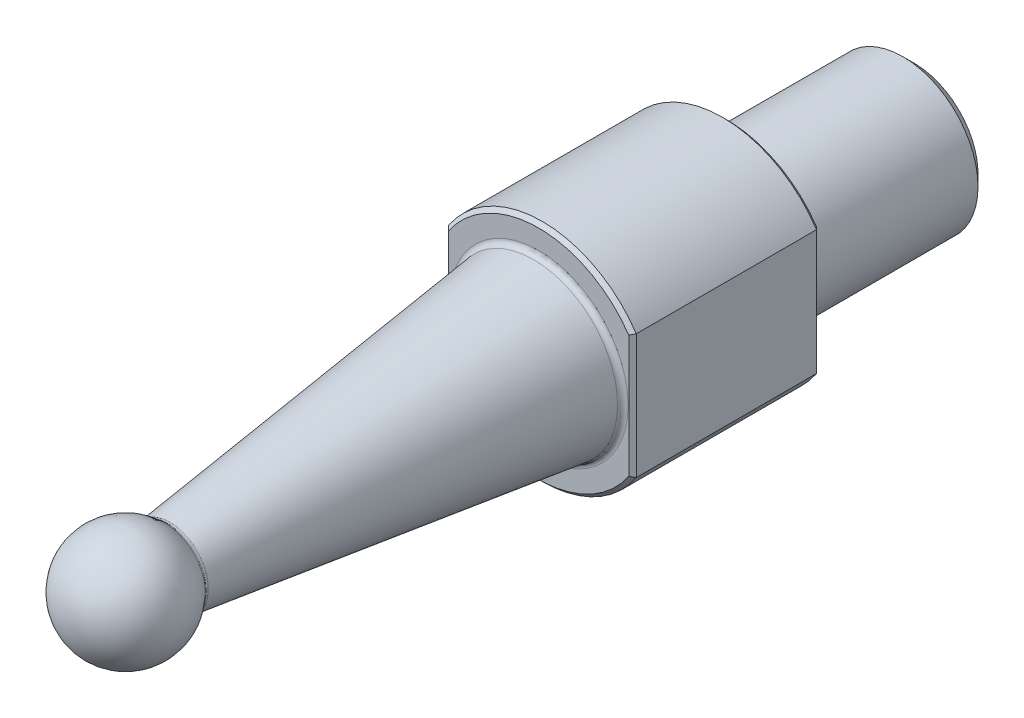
ISO-10303-21;
HEADER;
FILE_DESCRIPTION(('STEP AP214'),'2;1');
FILE_NAME('part.step','',(''),(''),'','','');
FILE_SCHEMA(('AUTOMOTIVE_DESIGN { 1 0 10303 214 1 1 1 1 }'));
ENDSEC;
DATA;
#1=APPLICATION_CONTEXT('core data for automotive mechanical design processes');
#2=APPLICATION_PROTOCOL_DEFINITION('international standard','automotive_design',2000,#1);
#3=PRODUCT_CONTEXT('',#1,'mechanical');
#4=PRODUCT('Part','Part','',(#3));
#5=PRODUCT_RELATED_PRODUCT_CATEGORY('part','',(#4));
#6=PRODUCT_DEFINITION_FORMATION('','',#4);
#7=PRODUCT_DEFINITION_CONTEXT('part definition',#1,'design');
#8=PRODUCT_DEFINITION('design','',#6,#7);
#9=PRODUCT_DEFINITION_SHAPE('','',#8);
#10=(LENGTH_UNIT() NAMED_UNIT(*) SI_UNIT(.MILLI.,.METRE.));
#11=(NAMED_UNIT(*) PLANE_ANGLE_UNIT() SI_UNIT($,.RADIAN.));
#12=(NAMED_UNIT(*) SI_UNIT($,.STERADIAN.) SOLID_ANGLE_UNIT());
#13=UNCERTAINTY_MEASURE_WITH_UNIT(LENGTH_MEASURE(1.E-05),#10,'distance_accuracy_value','');
#14=(GEOMETRIC_REPRESENTATION_CONTEXT(3) GLOBAL_UNCERTAINTY_ASSIGNED_CONTEXT((#13)) GLOBAL_UNIT_ASSIGNED_CONTEXT((#10,
#11,#12)) REPRESENTATION_CONTEXT('',''));
#15=CARTESIAN_POINT('',(0.,0.,0.));
#16=DIRECTION('',(0.,0.,1.));
#17=DIRECTION('',(1.,0.,0.));
#18=AXIS2_PLACEMENT_3D('',#15,#16,#17);
#19=CARTESIAN_POINT('',(529.857156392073,-136.049111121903,0.));
#20=DIRECTION('',(0.,0.,1.));
#21=DIRECTION('',(1.,0.,0.));
#22=AXIS2_PLACEMENT_3D('',#19,#20,#21);
#23=PLANE('',#22);
#24=CARTESIAN_POINT('',(529.857156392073,-136.049111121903,0.));
#25=DIRECTION('',(0.,0.,1.));
#26=DIRECTION('',(1.,0.,0.));
#27=AXIS2_PLACEMENT_3D('',#24,#25,#26);
#28=CIRCLE('',#27,2.9);
#29=CARTESIAN_POINT('',(532.257156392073,-137.676993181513,0.));
#30=VERTEX_POINT('',#29);
#31=CARTESIAN_POINT('',(527.457156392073,-137.676993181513,0.));
#32=VERTEX_POINT('',#31);
#33=EDGE_CURVE('E197',#30,#32,#28,.F.);
#34=ORIENTED_EDGE('',*,*,#33,.T.);
#35=DIRECTION('',(0.,1.,0.));
#36=VECTOR('',#35,1.);
#37=CARTESIAN_POINT('',(527.457156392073,-134.390798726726,0.));
#38=LINE('',#37,#36);
#39=CARTESIAN_POINT('',(527.457156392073,-134.421229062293,0.));
#40=VERTEX_POINT('',#39);
#41=EDGE_CURVE('E199',#32,#40,#38,.T.);
#42=ORIENTED_EDGE('',*,*,#41,.T.);
#43=CARTESIAN_POINT('',(529.857156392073,-136.049111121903,0.));
#44=DIRECTION('',(0.,0.,1.));
#45=DIRECTION('',(1.,0.,0.));
#46=AXIS2_PLACEMENT_3D('',#43,#44,#45);
#47=CIRCLE('',#46,2.89999999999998);
#48=CARTESIAN_POINT('',(532.257156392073,-134.421229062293,0.));
#49=VERTEX_POINT('',#48);
#50=EDGE_CURVE('E193',#40,#49,#47,.F.);
#51=ORIENTED_EDGE('',*,*,#50,.T.);
#52=DIRECTION('',(0.,-1.,0.));
#53=VECTOR('',#52,1.);
#54=CARTESIAN_POINT('',(532.257156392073,-137.707423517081,0.));
#55=LINE('',#54,#53);
#56=EDGE_CURVE('E195',#49,#30,#55,.T.);
#57=ORIENTED_EDGE('',*,*,#56,.T.);
#58=EDGE_LOOP('',(#34,#42,#51,#57));
#59=FACE_BOUND('',#58,.T.);
#60=CARTESIAN_POINT('',(529.857156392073,-136.049111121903,0.));
#61=DIRECTION('',(0.,0.,1.));
#62=DIRECTION('',(1.,0.,0.));
#63=AXIS2_PLACEMENT_3D('',#60,#61,#62);
#64=CIRCLE('',#63,2.);
#65=CARTESIAN_POINT('',(531.857156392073,-136.049111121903,0.));
#66=VERTEX_POINT('',#65);
#67=EDGE_CURVE('E180',#66,#66,#64,.F.);
#68=ORIENTED_EDGE('',*,*,#67,.F.);
#69=EDGE_LOOP('',(#68));
#70=FACE_BOUND('',#69,.T.);
#71=ADVANCED_FACE('F45',(#59,#70),#23,.F.);
#72=CARTESIAN_POINT('',(529.857156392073,-136.049111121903,16.));
#73=DIRECTION('',(0.999972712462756,0.00401121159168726,0.00620358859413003));
#74=DIRECTION('',(-0.00399590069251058,0.999988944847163,-0.00247849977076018));
#75=AXIS2_PLACEMENT_3D('',#72,#73,#74);
#76=SPHERICAL_SURFACE('',#75,1.5);
#77=CARTESIAN_POINT('',(528.798125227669,-135.937211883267,14.9436233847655));
#78=CARTESIAN_POINT('',(528.849242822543,-135.942613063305,14.8918052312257));
#79=CARTESIAN_POINT('',(528.840239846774,-135.941661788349,14.8193804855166));
#80=CARTESIAN_POINT('',(528.79182810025,-135.996808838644,14.943623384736));
#81=CARTESIAN_POINT('',(528.843249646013,-135.999333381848,14.8918052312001));
#82=CARTESIAN_POINT('',(528.834193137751,-135.998888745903,14.8193804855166));
#83=CARTESIAN_POINT('',(528.790573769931,-136.056938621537,14.9436233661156));
#84=CARTESIAN_POINT('',(528.842055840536,-136.056560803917,14.8918052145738));
#85=CARTESIAN_POINT('',(528.832988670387,-136.056627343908,14.8193804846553));
#86=CARTESIAN_POINT('',(528.798179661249,-136.176453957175,14.9436233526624));
#87=CARTESIAN_POINT('',(528.849294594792,-136.170307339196,14.8918052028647));
#88=CARTESIAN_POINT('',(528.840292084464,-136.171389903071,14.8193804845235));
#89=CARTESIAN_POINT('',(528.807023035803,-136.2358405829,14.94362335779));
#90=CARTESIAN_POINT('',(528.857711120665,-136.226827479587,14.8918052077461));
#91=CARTESIAN_POINT('',(528.848783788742,-136.228414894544,14.8193804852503));
#92=CARTESIAN_POINT('',(528.834567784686,-136.352378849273,14.9436233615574));
#93=CARTESIAN_POINT('',(528.883926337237,-136.337740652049,14.8918052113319));
#94=CARTESIAN_POINT('',(528.875233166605,-136.34031877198,14.8193804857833));
#95=CARTESIAN_POINT('',(528.853284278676,-136.409526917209,14.9436233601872));
#96=CARTESIAN_POINT('',(528.901739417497,-136.392130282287,14.8918052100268));
#97=CARTESIAN_POINT('',(528.893205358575,-136.395194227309,14.8193804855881));
#98=CARTESIAN_POINT('',(528.900019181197,-136.519788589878,14.9436233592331));
#99=CARTESIAN_POINT('',(528.946218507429,-136.497069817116,14.8918052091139));
#100=CARTESIAN_POINT('',(528.93808174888,-136.501071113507,14.8193804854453));
#101=CARTESIAN_POINT('',(528.928024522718,-136.572907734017,14.9436233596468));
#102=CARTESIAN_POINT('',(528.972872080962,-136.547624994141,14.8918052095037));
#103=CARTESIAN_POINT('',(528.964973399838,-136.552077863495,14.8193804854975));
#104=CARTESIAN_POINT('',(528.992595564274,-136.673765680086,14.9436233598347));
#105=CARTESIAN_POINT('',(529.034326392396,-136.643614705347,14.8918052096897));
#106=CARTESIAN_POINT('',(529.026976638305,-136.648924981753,14.8193804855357));
#107=CARTESIAN_POINT('',(529.029173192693,-136.721496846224,14.943623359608));
#108=CARTESIAN_POINT('',(529.069138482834,-136.689041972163,14.8918052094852));
#109=CARTESIAN_POINT('',(529.062099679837,-136.694758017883,14.8193804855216));
#110=CARTESIAN_POINT('',(529.109770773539,-136.810073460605,14.9436233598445));
#111=CARTESIAN_POINT('',(529.145845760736,-136.773343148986,14.8918052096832));
#112=CARTESIAN_POINT('',(529.139492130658,-136.779812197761,14.8193804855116));
#113=CARTESIAN_POINT('',(529.153780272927,-136.850928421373,14.9436233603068));
#114=CARTESIAN_POINT('',(529.187730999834,-136.812226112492,14.891805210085));
#115=CARTESIAN_POINT('',(529.18175150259,-136.819042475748,14.8193804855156));
#116=CARTESIAN_POINT('',(529.248096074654,-136.924727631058,14.9436233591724));
#117=CARTESIAN_POINT('',(529.27749434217,-136.882463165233,14.8918052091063));
#118=CARTESIAN_POINT('',(529.272316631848,-136.889906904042,14.8193804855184));
#119=CARTESIAN_POINT('',(529.298411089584,-136.957660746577,14.9436233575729));
#120=CARTESIAN_POINT('',(529.325380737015,-136.91380665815,14.8918052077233));
#121=CARTESIAN_POINT('',(529.320630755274,-136.921530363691,14.8193804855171));
#122=CARTESIAN_POINT('',(529.403784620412,-137.014565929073,14.9436233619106));
#123=CARTESIAN_POINT('',(529.425668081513,-136.967965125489,14.8918052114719));
#124=CARTESIAN_POINT('',(529.421813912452,-136.976172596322,14.8193804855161));
#125=CARTESIAN_POINT('',(529.458836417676,-137.038550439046,14.9436233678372));
#126=CARTESIAN_POINT('',(529.478062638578,-136.990791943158,14.8918052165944));
#127=CARTESIAN_POINT('',(529.474676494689,-136.999203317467,14.8193804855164));
#128=CARTESIAN_POINT('',(529.572263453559,-137.076970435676,14.9436233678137));
#129=CARTESIAN_POINT('',(529.586014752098,-137.027357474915,14.8918052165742));
#130=CARTESIAN_POINT('',(529.583592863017,-137.036095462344,14.8193804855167));
#131=CARTESIAN_POINT('',(529.630643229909,-137.091392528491,14.943623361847));
#132=CARTESIAN_POINT('',(529.641576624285,-137.041083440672,14.8918052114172));
#133=CARTESIAN_POINT('',(529.639651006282,-137.049944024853,14.8193804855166));
#134=CARTESIAN_POINT('',(529.74891269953,-137.110210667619,14.943623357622));
#135=CARTESIAN_POINT('',(529.754137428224,-137.058993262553,14.8918052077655));
#136=CARTESIAN_POINT('',(529.753217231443,-137.068013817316,14.8193804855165));
#137=CARTESIAN_POINT('',(529.808800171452,-137.114620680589,14.943623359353));
#138=CARTESIAN_POINT('',(529.811134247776,-137.063190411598,14.8918052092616));
#139=CARTESIAN_POINT('',(529.810723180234,-137.072248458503,14.8193804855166));
#140=CARTESIAN_POINT('',(529.928550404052,-137.113329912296,14.9436233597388));
#141=CARTESIAN_POINT('',(529.925104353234,-137.061961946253,14.8918052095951));
#142=CARTESIAN_POINT('',(529.925711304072,-137.07100902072,14.8193804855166));
#143=CARTESIAN_POINT('',(529.98841301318,-137.107614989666,14.9436233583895));
#144=CARTESIAN_POINT('',(529.98207749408,-137.056522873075,14.8918052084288));
#145=CARTESIAN_POINT('',(529.983193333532,-137.065521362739,14.8193804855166));
#146=CARTESIAN_POINT('',(530.106244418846,-137.086224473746,14.9436233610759));
#147=CARTESIAN_POINT('',(530.094221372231,-137.036164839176,14.8918052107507));
#148=CARTESIAN_POINT('',(530.096338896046,-137.044981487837,14.8193804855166));
#149=CARTESIAN_POINT('',(530.1642157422,-137.070562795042,14.9436233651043));
#150=CARTESIAN_POINT('',(530.149394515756,-137.021259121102,14.8918052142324));
#151=CARTESIAN_POINT('',(530.152004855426,-137.029942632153,14.8193804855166));
#152=CARTESIAN_POINT('',(530.276788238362,-137.029706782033,14.9436233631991));
#153=CARTESIAN_POINT('',(530.256533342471,-136.982375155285,14.8918052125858));
#154=CARTESIAN_POINT('',(530.260100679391,-136.990711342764,14.8193804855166));
#155=CARTESIAN_POINT('',(530.331384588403,-137.004499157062,14.9436233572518));
#156=CARTESIAN_POINT('',(530.308494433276,-136.958384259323,14.8918052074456));
#157=CARTESIAN_POINT('',(530.312525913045,-136.966506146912,14.8193804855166));
#158=CARTESIAN_POINT('',(530.435493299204,-136.945311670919,14.9436233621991));
#159=CARTESIAN_POINT('',(530.407577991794,-136.902053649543,14.8918052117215));
#160=CARTESIAN_POINT('',(530.412494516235,-136.909672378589,14.8193804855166));
#161=CARTESIAN_POINT('',(530.48501264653,-136.911344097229,14.9436233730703));
#162=CARTESIAN_POINT('',(530.454707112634,-136.869725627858,14.8918052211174));
#163=CARTESIAN_POINT('',(530.460044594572,-136.877055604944,14.8193804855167));
#164=CARTESIAN_POINT('',(530.577715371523,-136.835529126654,14.9436233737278));
#165=CARTESIAN_POINT('',(530.542935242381,-136.797570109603,14.8918052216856));
#166=CARTESIAN_POINT('',(530.549060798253,-136.804255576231,14.8193804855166));
#167=CARTESIAN_POINT('',(530.620889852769,-136.793670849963,14.9436233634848));
#168=CARTESIAN_POINT('',(530.584025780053,-136.757732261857,14.8918052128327));
#169=CARTESIAN_POINT('',(530.590518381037,-136.764061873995,14.8193804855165));
#170=CARTESIAN_POINT('',(530.699538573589,-136.703360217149,14.9436233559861));
#171=CARTESIAN_POINT('',(530.658878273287,-136.671780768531,14.8918052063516));
#172=CARTESIAN_POINT('',(530.666039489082,-136.677342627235,14.8193804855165));
#173=CARTESIAN_POINT('',(530.735023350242,-136.654917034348,14.9436233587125));
#174=CARTESIAN_POINT('',(530.692650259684,-136.625675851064,14.8918052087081));
#175=CARTESIAN_POINT('',(530.700113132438,-136.630825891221,14.8193804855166));
#176=CARTESIAN_POINT('',(530.797402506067,-136.552691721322,14.9436233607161));
#177=CARTESIAN_POINT('',(530.752018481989,-136.528384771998,14.8918052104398));
#178=CARTESIAN_POINT('',(530.760011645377,-136.532665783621,14.8193804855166));
#179=CARTESIAN_POINT('',(530.824285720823,-136.498902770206,14.9436233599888));
#180=CARTESIAN_POINT('',(530.777604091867,-136.477192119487,14.8918052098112));
#181=CARTESIAN_POINT('',(530.785825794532,-136.481015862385,14.8193804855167));
#182=CARTESIAN_POINT('',(530.868609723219,-136.387662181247,14.943623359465));
#183=CARTESIAN_POINT('',(530.819788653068,-136.371320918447,14.8918052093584));
#184=CARTESIAN_POINT('',(530.82838716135,-136.374198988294,14.8193804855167));
#185=CARTESIAN_POINT('',(530.886061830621,-136.330215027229,14.9436233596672));
#186=CARTESIAN_POINT('',(530.83639837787,-136.316646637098,14.8918052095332));
#187=CARTESIAN_POINT('',(530.845145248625,-136.319036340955,14.8193804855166));
#188=CARTESIAN_POINT('',(530.914173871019,-136.198603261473,14.9436233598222));
#189=CARTESIAN_POINT('',(530.863153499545,-136.191387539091,14.8918052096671));
#190=CARTESIAN_POINT('',(530.872139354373,-136.192658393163,14.8193804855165));
#191=CARTESIAN_POINT('',(530.92207489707,-136.123826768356,14.9436233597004));
#192=CARTESIAN_POINT('',(530.870673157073,-136.120220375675,14.8918052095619));
#193=CARTESIAN_POINT('',(530.879726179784,-136.120855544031,14.8193804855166));
#194=CARTESIAN_POINT('',(530.922089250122,-135.989246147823,14.9436233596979));
#195=CARTESIAN_POINT('',(530.870686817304,-135.992135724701,14.8918052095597));
#196=CARTESIAN_POINT('',(530.87973996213,-135.991626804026,14.8193804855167));
#197=CARTESIAN_POINT('',(530.917028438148,-135.929420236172,14.943623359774));
#198=CARTESIAN_POINT('',(530.865870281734,-135.935197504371,14.8918052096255));
#199=CARTESIAN_POINT('',(530.874880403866,-135.934179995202,14.8193804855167));
#200=CARTESIAN_POINT('',(530.896931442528,-135.811372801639,14.9436233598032));
#201=CARTESIAN_POINT('',(530.846743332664,-135.822848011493,14.8918052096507));
#202=CARTESIAN_POINT('',(530.855582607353,-135.820826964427,14.8193804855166));
#203=CARTESIAN_POINT('',(530.881883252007,-135.753153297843,14.9436233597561));
#204=CARTESIAN_POINT('',(530.832421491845,-135.767438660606,14.89180520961));
#205=CARTESIAN_POINT('',(530.841132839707,-135.764922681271,14.8193804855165));
#206=CARTESIAN_POINT('',(530.842245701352,-135.640148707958,14.9436233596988));
#207=CARTESIAN_POINT('',(530.794697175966,-135.65988860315,14.8918052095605));
#208=CARTESIAN_POINT('',(530.803071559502,-135.656411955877,14.8193804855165));
#209=CARTESIAN_POINT('',(530.817668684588,-135.585359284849,14.9436233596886));
#210=CARTESIAN_POINT('',(530.771306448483,-135.607743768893,14.8918052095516));
#211=CARTESIAN_POINT('',(530.779471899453,-135.603801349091,14.8193804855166));
#212=CARTESIAN_POINT('',(530.759630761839,-135.48060607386,14.9436233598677));
#213=CARTESIAN_POINT('',(530.716069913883,-135.50804681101,14.8918052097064));
#214=CARTESIAN_POINT('',(530.723741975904,-135.503213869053,14.8193804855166));
#215=CARTESIAN_POINT('',(530.726157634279,-135.430649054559,14.9436233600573));
#216=CARTESIAN_POINT('',(530.684212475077,-135.460501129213,14.8918052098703));
#217=CARTESIAN_POINT('',(530.691599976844,-135.455243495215,14.8193804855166));
#218=CARTESIAN_POINT('',(530.651346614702,-135.337134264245,14.9436233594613));
#219=CARTESIAN_POINT('',(530.61301245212,-135.371500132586,14.8918052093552));
#220=CARTESIAN_POINT('',(530.619763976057,-135.36544751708,14.8193804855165));
#221=CARTESIAN_POINT('',(530.610019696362,-135.293567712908,14.9436233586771));
#222=CARTESIAN_POINT('',(530.573680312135,-135.330036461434,14.8918052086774));
#223=CARTESIAN_POINT('',(530.580080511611,-135.323613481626,14.8193804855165));
#224=CARTESIAN_POINT('',(530.520579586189,-135.213929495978,14.9436233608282));
#225=CARTESIAN_POINT('',(530.488557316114,-135.254242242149,14.8918052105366));
#226=CARTESIAN_POINT('',(530.494197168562,-135.247142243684,14.8193804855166));
#227=CARTESIAN_POINT('',(530.472456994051,-135.177868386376,14.9436233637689));
#228=CARTESIAN_POINT('',(530.442757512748,-135.21992173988,14.8918052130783));
#229=CARTESIAN_POINT('',(530.447988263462,-135.212515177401,14.8193804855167));
#230=CARTESIAN_POINT('',(530.370908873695,-135.11438797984,14.9436233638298));
#231=CARTESIAN_POINT('',(530.346110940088,-135.159505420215,14.8918052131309));
#232=CARTESIAN_POINT('',(530.350478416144,-135.151559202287,14.8193804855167));
#233=CARTESIAN_POINT('',(530.317490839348,-135.086956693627,14.9436233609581));
#234=CARTESIAN_POINT('',(530.29527130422,-135.133398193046,14.891805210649));
#235=CARTESIAN_POINT('',(530.299184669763,-135.125218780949,14.8193804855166));
#236=CARTESIAN_POINT('',(530.206731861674,-135.041412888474,14.9436233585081));
#237=CARTESIAN_POINT('',(530.189858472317,-135.090052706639,14.8918052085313));
#238=CARTESIAN_POINT('',(530.192830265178,-135.081486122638,14.8193804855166));
#239=CARTESIAN_POINT('',(530.149385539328,-135.02331344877,14.9436233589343));
#240=CARTESIAN_POINT('',(530.135280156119,-135.072826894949,14.8918052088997));
#241=CARTESIAN_POINT('',(530.137764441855,-135.064106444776,14.8193804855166));
#242=CARTESIAN_POINT('',(530.032549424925,-134.997024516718,14.9436233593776));
#243=CARTESIAN_POINT('',(530.024083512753,-135.047806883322,14.8918052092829));
#244=CARTESIAN_POINT('',(530.025574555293,-135.038862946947,14.8193804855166));
#245=CARTESIAN_POINT('',(529.973062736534,-134.988821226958,14.9436233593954));
#246=CARTESIAN_POINT('',(529.967468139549,-135.039999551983,14.8918052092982));
#247=CARTESIAN_POINT('',(529.968453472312,-135.030985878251,14.8193804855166));
#248=CARTESIAN_POINT('',(529.853472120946,-134.982506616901,14.9436233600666));
#249=CARTESIAN_POINT('',(529.853649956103,-135.033989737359,14.8918052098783));
#250=CARTESIAN_POINT('',(529.853618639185,-135.024922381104,14.8193804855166));
#251=CARTESIAN_POINT('',(529.793367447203,-134.984409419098,14.9436233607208));
#252=CARTESIAN_POINT('',(529.796446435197,-135.035800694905,14.8918052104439));
#253=CARTESIAN_POINT('',(529.795904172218,-135.026749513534,14.8193804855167));
#254=CARTESIAN_POINT('',(529.674415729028,-134.99827583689,14.9436233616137));
#255=CARTESIAN_POINT('',(529.683236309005,-135.048997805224,14.8918052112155));
#256=CARTESIAN_POINT('',(529.681682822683,-135.040064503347,14.8193804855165));
#257=CARTESIAN_POINT('',(529.615567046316,-135.010225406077,14.9436233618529));
#258=CARTESIAN_POINT('',(529.62722814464,-135.06037058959,14.891805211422));
#259=CARTESIAN_POINT('',(529.625174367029,-135.051538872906,14.8193804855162));
#260=CARTESIAN_POINT('',(529.500627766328,-135.043851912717,14.9436233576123));
#261=CARTESIAN_POINT('',(529.517836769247,-135.092374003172,14.8918052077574));
#262=CARTESIAN_POINT('',(529.5148058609,-135.083828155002,14.819380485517));
#263=CARTESIAN_POINT('',(529.444541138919,-135.065542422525,14.943623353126));
#264=CARTESIAN_POINT('',(529.464457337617,-135.113017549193,14.8918052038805));
#265=CARTESIAN_POINT('',(529.460949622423,-135.104656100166,14.819380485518));
#266=CARTESIAN_POINT('',(529.336884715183,-135.11800086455,14.9436233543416));
#267=CARTESIAN_POINT('',(529.361997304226,-135.162943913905,14.8918052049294));
#268=CARTESIAN_POINT('',(529.357574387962,-135.155028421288,14.8193804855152));
#269=CARTESIAN_POINT('',(529.285308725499,-135.148756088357,14.9436233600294));
#270=CARTESIAN_POINT('',(529.312910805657,-135.192214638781,14.891805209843));
#271=CARTESIAN_POINT('',(529.308049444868,-135.184560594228,14.8193804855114));
#272=CARTESIAN_POINT('',(529.187979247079,-135.218532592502,14.943623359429));
#273=CARTESIAN_POINT('',(529.220279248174,-135.258623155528,14.8918052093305));
#274=CARTESIAN_POINT('',(529.214590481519,-135.251562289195,14.8193804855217));
#275=CARTESIAN_POINT('',(529.142233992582,-135.257565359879,14.9436233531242));
#276=CARTESIAN_POINT('',(529.176742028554,-135.295771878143,14.8918052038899));
#277=CARTESIAN_POINT('',(529.170664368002,-135.289042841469,14.8193804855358));
#278=CARTESIAN_POINT('',(529.058010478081,-135.342701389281,14.9436233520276));
#279=CARTESIAN_POINT('',(529.096583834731,-135.376798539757,14.8918052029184));
#280=CARTESIAN_POINT('',(529.089790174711,-135.370793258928,14.8193804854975));
#281=CARTESIAN_POINT('',(529.01952214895,-135.388794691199,14.9436233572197));
#282=CARTESIAN_POINT('',(529.059953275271,-135.420667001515,14.8918052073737));
#283=CARTESIAN_POINT('',(529.052832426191,-135.415053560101,14.8193804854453));
#284=CARTESIAN_POINT('',(528.950775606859,-135.486854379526,14.9436233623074));
#285=CARTESIAN_POINT('',(528.994525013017,-135.513993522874,14.8918052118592));
#286=CARTESIAN_POINT('',(528.986819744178,-135.509213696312,14.819380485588));
#287=CARTESIAN_POINT('',(528.920529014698,-135.538828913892,14.9436233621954));
#288=CARTESIAN_POINT('',(528.965738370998,-135.563459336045,14.8918052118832));
#289=CARTESIAN_POINT('',(528.957775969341,-135.559121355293,14.8193804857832));
#290=CARTESIAN_POINT('',(528.869237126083,-135.647037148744,14.9436233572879));
#291=CARTESIAN_POINT('',(528.916922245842,-135.666444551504,14.8918052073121));
#292=CARTESIAN_POINT('',(528.908523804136,-135.663026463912,14.8193804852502));
#293=CARTESIAN_POINT('',(528.848177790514,-135.703264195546,14.9436233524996));
#294=CARTESIAN_POINT('',(528.896879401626,-135.719957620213,14.8918052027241));
#295=CARTESIAN_POINT('',(528.888301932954,-135.717017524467,14.8193804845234));
#296=CARTESIAN_POINT('',(528.815762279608,-135.818550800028,14.9436233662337));
#297=CARTESIAN_POINT('',(528.866028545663,-135.82967953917,14.891805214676));
#298=CARTESIAN_POINT('',(528.857175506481,-135.82771951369,14.8193804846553));
#299=CARTESIAN_POINT('',(528.804422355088,-135.87761492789,14.9436233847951));
#300=CARTESIAN_POINT('',(528.855235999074,-135.885892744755,14.8918052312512));
#301=CARTESIAN_POINT('',(528.846286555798,-135.884434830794,14.8193804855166));
#302=CARTESIAN_POINT('',(528.798125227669,-135.937211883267,14.9436233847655));
#303=CARTESIAN_POINT('',(528.849242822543,-135.942613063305,14.8918052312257));
#304=CARTESIAN_POINT('',(528.840239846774,-135.941661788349,14.8193804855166));
#305=(BOUNDED_SURFACE() B_SPLINE_SURFACE(3,2,((#77,#78,#79),(#80,#81,#82),(#83,#84,#85),(#86,
#87,#88),(#89,#90,#91),(#92,#93,#94),(#95,#96,#97),(#98,#99,#100),(#101,#102,#103),(#104,#105,
#106),(#107,#108,#109),(#110,#111,#112),(#113,#114,#115),(#116,#117,#118),(#119,#120,#121),
(#122,#123,#124),(#125,#126,#127),(#128,#129,#130),(#131,#132,#133),(#134,#135,#136),(#137,#138,
#139),(#140,#141,#142),(#143,#144,#145),(#146,#147,#148),(#149,#150,#151),(#152,#153,#154),
(#155,#156,#157),(#158,#159,#160),(#161,#162,#163),(#164,#165,#166),(#167,#168,#169),(#170,#171,
#172),(#173,#174,#175),(#176,#177,#178),(#179,#180,#181),(#182,#183,#184),(#185,#186,#187),
(#188,#189,#190),(#191,#192,#193),(#194,#195,#196),(#197,#198,#199),(#200,#201,#202),(#203,#204,
#205),(#206,#207,#208),(#209,#210,#211),(#212,#213,#214),(#215,#216,#217),(#218,#219,#220),
(#221,#222,#223),(#224,#225,#226),(#227,#228,#229),(#230,#231,#232),(#233,#234,#235),(#236,#237,
#238),(#239,#240,#241),(#242,#243,#244),(#245,#246,#247),(#248,#249,#250),(#251,#252,#253),
(#254,#255,#256),(#257,#258,#259),(#260,#261,#262),(#263,#264,#265),(#266,#267,#268),(#269,#270,
#271),(#272,#273,#274),(#275,#276,#277),(#278,#279,#280),(#281,#282,#283),(#284,#285,#286),
(#287,#288,#289),(#290,#291,#292),(#293,#294,#295),(#296,#297,#298),(#299,#300,#301),(#302,#303,
#304)),.UNSPECIFIED.,.T.,.F.,.F.) B_SPLINE_SURFACE_WITH_KNOTS((4,2,2,2,2,2,2,2,2,2,2,2,2,2,2,2,
2,2,2,2,2,2,2,2,2,2,2,2,2,2,2,2,2,2,2,2,2,4),(3,3),(0.,0.197530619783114,0.39473215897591,
0.592236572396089,0.789464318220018,0.98696815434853,1.18419647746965,1.38170038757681,
1.578928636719,1.77643255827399,1.97366079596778,2.17116471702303,2.36839295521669,
2.56589680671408,2.76312511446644,2.96062737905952,3.15785727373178,3.35534213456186,
3.55258943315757,3.79876776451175,3.99601506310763,4.19349992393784,4.39072981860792,
4.58823208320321,4.78546039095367,4.9829642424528,5.18019248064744,5.3776964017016,
5.57492463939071,5.77242856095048,5.9696568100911,6.16716072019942,6.36438904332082,
6.56189287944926,6.75912062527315,6.95662503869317,7.15382657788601,7.35135719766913),(0.,1.),
.UNSPECIFIED.) GEOMETRIC_REPRESENTATION_ITEM() RATIONAL_B_SPLINE_SURFACE(((1.,0.899198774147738,
1.),(1.,0.899198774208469,1.),(1.,0.899198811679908,1.),(1.,0.899198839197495,1.),(1.,
0.899198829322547,1.),(1.,0.899198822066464,1.),(1.,0.899198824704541,1.),(1.,0.899198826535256,
1.),(1.,0.899198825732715,1.),(1.,0.899198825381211,1.),(1.,0.899198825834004,1.),(1.,
0.899198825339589,1.),(1.,0.899198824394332,1.),(1.,0.899198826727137,1.),(1.,0.899198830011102,
1.),(1.,0.899198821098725,1.),(1.,0.899198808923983,1.),(1.,0.899198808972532,1.),(1.,
0.899198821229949,1.),(1.,0.899198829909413,1.),(1.,0.89919882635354,1.),(1.,0.899198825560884,
1.),(1.,0.89919882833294,1.),(1.,0.899198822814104,1.),(1.,0.899198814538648,1.),(1.,
0.899198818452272,1.),(1.,0.899198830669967,1.),(1.,0.899198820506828,1.),(1.,0.89919879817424,
1.),(1.,0.899198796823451,1.),(1.,0.899198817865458,1.),(1.,0.899198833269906,1.),(1.,
0.8991988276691,1.),(1.,0.899198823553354,1.),(1.,0.899198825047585,1.),(1.,0.899198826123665,
1.),(1.,0.899198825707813,1.),(1.,0.899198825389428,1.),(1.,0.899198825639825,1.),(1.,
0.899198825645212,1.),(1.,0.899198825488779,1.),(1.,0.89919882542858,1.),(1.,0.899198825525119,
1.),(1.,0.89919882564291,1.),(1.,0.89919882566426,1.),(1.,0.899198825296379,1.),(1.,
0.899198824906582,1.),(1.,0.899198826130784,1.),(1.,0.899198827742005,1.),(1.,0.899198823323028,
1.),(1.,0.899198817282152,1.),(1.,0.899198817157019,1.),(1.,0.899198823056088,1.),(1.,
0.899198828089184,1.),(1.,0.899198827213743,1.),(1.,0.899198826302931,1.),(1.,0.899198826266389,
1.),(1.,0.899198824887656,1.),(1.,0.899198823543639,1.),(1.,0.899198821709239,1.),(1.,
0.899198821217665,1.),(1.,0.899198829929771,1.),(1.,0.899198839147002,1.),(1.,0.899198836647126,
1.),(1.,0.899198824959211,1.),(1.,0.899198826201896,1.),(1.,0.899198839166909,1.),(1.,
0.899198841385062,1.),(1.,0.899198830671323,1.),(1.,0.899198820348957,1.),(1.,0.899198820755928,
1.),(1.,0.899198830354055,1.),(1.,0.89919883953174,1.),(1.,0.899198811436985,1.),(1.,
0.899198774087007,1.),(1.,0.899198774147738,1.))) REPRESENTATION_ITEM('') SURFACE());
#306=CARTESIAN_POINT('',(528.798125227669,-135.937211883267,14.9436233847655));
#307=CARTESIAN_POINT('',(528.79182810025,-135.996808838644,14.943623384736));
#308=CARTESIAN_POINT('',(528.790573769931,-136.056938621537,14.9436233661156));
#309=CARTESIAN_POINT('',(528.798179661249,-136.176453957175,14.9436233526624));
#310=CARTESIAN_POINT('',(528.807023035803,-136.2358405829,14.94362335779));
#311=CARTESIAN_POINT('',(528.834567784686,-136.352378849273,14.9436233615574));
#312=CARTESIAN_POINT('',(528.853284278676,-136.409526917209,14.9436233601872));
#313=CARTESIAN_POINT('',(528.900019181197,-136.519788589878,14.9436233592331));
#314=CARTESIAN_POINT('',(528.928024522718,-136.572907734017,14.9436233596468));
#315=CARTESIAN_POINT('',(528.992595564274,-136.673765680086,14.9436233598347));
#316=CARTESIAN_POINT('',(529.029173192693,-136.721496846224,14.943623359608));
#317=CARTESIAN_POINT('',(529.109770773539,-136.810073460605,14.9436233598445));
#318=CARTESIAN_POINT('',(529.153780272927,-136.850928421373,14.9436233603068));
#319=CARTESIAN_POINT('',(529.248096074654,-136.924727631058,14.9436233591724));
#320=CARTESIAN_POINT('',(529.298411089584,-136.957660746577,14.9436233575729));
#321=CARTESIAN_POINT('',(529.403784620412,-137.014565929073,14.9436233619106));
#322=CARTESIAN_POINT('',(529.458836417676,-137.038550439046,14.9436233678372));
#323=CARTESIAN_POINT('',(529.572263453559,-137.076970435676,14.9436233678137));
#324=CARTESIAN_POINT('',(529.630643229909,-137.091392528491,14.943623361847));
#325=CARTESIAN_POINT('',(529.74891269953,-137.110210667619,14.943623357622));
#326=CARTESIAN_POINT('',(529.808800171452,-137.114620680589,14.943623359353));
#327=CARTESIAN_POINT('',(529.928550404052,-137.113329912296,14.9436233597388));
#328=CARTESIAN_POINT('',(529.98841301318,-137.107614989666,14.9436233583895));
#329=CARTESIAN_POINT('',(530.106244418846,-137.086224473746,14.9436233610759));
#330=CARTESIAN_POINT('',(530.1642157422,-137.070562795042,14.9436233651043));
#331=CARTESIAN_POINT('',(530.276788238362,-137.029706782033,14.9436233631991));
#332=CARTESIAN_POINT('',(530.331384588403,-137.004499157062,14.9436233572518));
#333=CARTESIAN_POINT('',(530.435493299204,-136.945311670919,14.9436233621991));
#334=CARTESIAN_POINT('',(530.48501264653,-136.911344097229,14.9436233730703));
#335=CARTESIAN_POINT('',(530.577715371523,-136.835529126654,14.9436233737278));
#336=CARTESIAN_POINT('',(530.620889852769,-136.793670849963,14.9436233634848));
#337=CARTESIAN_POINT('',(530.699538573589,-136.703360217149,14.9436233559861));
#338=CARTESIAN_POINT('',(530.735023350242,-136.654917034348,14.9436233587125));
#339=CARTESIAN_POINT('',(530.797402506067,-136.552691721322,14.9436233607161));
#340=CARTESIAN_POINT('',(530.824285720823,-136.498902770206,14.9436233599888));
#341=CARTESIAN_POINT('',(530.868609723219,-136.387662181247,14.943623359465));
#342=CARTESIAN_POINT('',(530.886061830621,-136.330215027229,14.9436233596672));
#343=CARTESIAN_POINT('',(530.914173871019,-136.198603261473,14.9436233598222));
#344=CARTESIAN_POINT('',(530.92207489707,-136.123826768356,14.9436233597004));
#345=CARTESIAN_POINT('',(530.922089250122,-135.989246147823,14.9436233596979));
#346=CARTESIAN_POINT('',(530.917028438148,-135.929420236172,14.943623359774));
#347=CARTESIAN_POINT('',(530.896931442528,-135.811372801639,14.9436233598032));
#348=CARTESIAN_POINT('',(530.881883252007,-135.753153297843,14.9436233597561));
#349=CARTESIAN_POINT('',(530.842245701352,-135.640148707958,14.9436233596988));
#350=CARTESIAN_POINT('',(530.817668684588,-135.585359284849,14.9436233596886));
#351=CARTESIAN_POINT('',(530.759630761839,-135.48060607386,14.9436233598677));
#352=CARTESIAN_POINT('',(530.726157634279,-135.430649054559,14.9436233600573));
#353=CARTESIAN_POINT('',(530.651346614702,-135.337134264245,14.9436233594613));
#354=CARTESIAN_POINT('',(530.610019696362,-135.293567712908,14.9436233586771));
#355=CARTESIAN_POINT('',(530.520579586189,-135.213929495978,14.9436233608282));
#356=CARTESIAN_POINT('',(530.472456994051,-135.177868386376,14.9436233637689));
#357=CARTESIAN_POINT('',(530.370908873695,-135.11438797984,14.9436233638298));
#358=CARTESIAN_POINT('',(530.317490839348,-135.086956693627,14.9436233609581));
#359=CARTESIAN_POINT('',(530.206731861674,-135.041412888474,14.9436233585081));
#360=CARTESIAN_POINT('',(530.149385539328,-135.02331344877,14.9436233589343));
#361=CARTESIAN_POINT('',(530.032549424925,-134.997024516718,14.9436233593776));
#362=CARTESIAN_POINT('',(529.973062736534,-134.988821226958,14.9436233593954));
#363=CARTESIAN_POINT('',(529.853472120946,-134.982506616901,14.9436233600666));
#364=CARTESIAN_POINT('',(529.793367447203,-134.984409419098,14.9436233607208));
#365=CARTESIAN_POINT('',(529.674415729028,-134.99827583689,14.9436233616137));
#366=CARTESIAN_POINT('',(529.615567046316,-135.010225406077,14.9436233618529));
#367=CARTESIAN_POINT('',(529.500627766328,-135.043851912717,14.9436233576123));
#368=CARTESIAN_POINT('',(529.444541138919,-135.065542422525,14.943623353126));
#369=CARTESIAN_POINT('',(529.336884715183,-135.11800086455,14.9436233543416));
#370=CARTESIAN_POINT('',(529.285308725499,-135.148756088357,14.9436233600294));
#371=CARTESIAN_POINT('',(529.187979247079,-135.218532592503,14.943623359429));
#372=CARTESIAN_POINT('',(529.142233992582,-135.257565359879,14.9436233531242));
#373=CARTESIAN_POINT('',(529.058010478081,-135.342701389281,14.9436233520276));
#374=CARTESIAN_POINT('',(529.01952214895,-135.388794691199,14.9436233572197));
#375=CARTESIAN_POINT('',(528.950775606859,-135.486854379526,14.9436233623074));
#376=CARTESIAN_POINT('',(528.920529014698,-135.538828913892,14.9436233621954));
#377=CARTESIAN_POINT('',(528.869237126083,-135.647037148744,14.9436233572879));
#378=CARTESIAN_POINT('',(528.848177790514,-135.703264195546,14.9436233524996));
#379=CARTESIAN_POINT('',(528.815762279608,-135.818550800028,14.9436233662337));
#380=CARTESIAN_POINT('',(528.804422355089,-135.87761492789,14.9436233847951));
#381=CARTESIAN_POINT('',(528.798125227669,-135.937211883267,14.9436233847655));
#382=B_SPLINE_CURVE_WITH_KNOTS('',3,(#306,#307,#308,#309,#310,#311,#312,#313,#314,#315,#316,
#317,#318,#319,#320,#321,#322,#323,#324,#325,#326,#327,#328,#329,#330,#331,#332,#333,#334,#335,
#336,#337,#338,#339,#340,#341,#342,#343,#344,#345,#346,#347,#348,#349,#350,#351,#352,#353,#354,
#355,#356,#357,#358,#359,#360,#361,#362,#363,#364,#365,#366,#367,#368,#369,#370,#371,#372,#373,
#374,#375,#376,#377,#378,#379,#380,#381),.UNSPECIFIED.,.T.,.F.,(4,2,2,2,2,2,2,2,2,2,2,2,2,2,2,2,
2,2,2,2,2,2,2,2,2,2,2,2,2,2,2,2,2,2,2,2,2,4),(0.,0.197530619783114,0.39473215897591,
0.592236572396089,0.789464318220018,0.98696815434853,1.18419647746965,1.38170038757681,
1.578928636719,1.77643255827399,1.97366079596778,2.17116471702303,2.36839295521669,
2.56589680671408,2.76312511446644,2.96062737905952,3.15785727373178,3.35534213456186,
3.55258943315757,3.79876776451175,3.99601506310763,4.19349992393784,4.39072981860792,
4.58823208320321,4.78546039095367,4.9829642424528,5.18019248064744,5.3776964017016,
5.57492463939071,5.77242856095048,5.9696568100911,6.16716072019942,6.36438904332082,
6.56189287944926,6.75912062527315,6.95662503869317,7.15382657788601,7.35135719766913),.UNSPECIFIED.);
#383=CARTESIAN_POINT('',(528.798125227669,-135.937211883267,14.9436233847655));
#384=VERTEX_POINT('',#383);
#385=EDGE_CURVE('E57',#384,#384,#382,.T.);
#386=ORIENTED_EDGE('',*,*,#385,.T.);
#387=EDGE_LOOP('',(#386));
#388=FACE_BOUND('',#387,.T.);
#389=CARTESIAN_POINT('',(531.357115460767,-136.043094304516,16.0093053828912));
#390=VERTEX_POINT('',#389);
#391=VERTEX_LOOP('',#390);
#392=FACE_BOUND('',#391,.T.);
#393=CARTESIAN_POINT('',(528.357197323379,-136.055127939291,15.9906946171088));
#394=VERTEX_POINT('',#393);
#395=VERTEX_LOOP('',#394);
#396=FACE_BOUND('',#395,.T.);
#397=ADVANCED_FACE('F120',(#388,#392,#396),#76,.T.);
#398=CARTESIAN_POINT('',(529.857156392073,-136.049111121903,5.00000000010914));
#399=DIRECTION('',(0.,0.,-1.));
#400=DIRECTION('',(-1.,0.,0.));
#401=AXIS2_PLACEMENT_3D('',#398,#399,#400);
#402=CONICAL_SURFACE('',#401,2.2499999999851,0.124354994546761);
#403=CARTESIAN_POINT('',(528.840239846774,-135.941661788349,14.8193804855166));
#404=CARTESIAN_POINT('',(528.846286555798,-135.884434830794,14.8193804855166));
#405=CARTESIAN_POINT('',(528.857175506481,-135.82771951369,14.8193804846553));
#406=CARTESIAN_POINT('',(528.888301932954,-135.717017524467,14.8193804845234));
#407=CARTESIAN_POINT('',(528.908523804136,-135.663026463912,14.8193804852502));
#408=CARTESIAN_POINT('',(528.957775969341,-135.559121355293,14.8193804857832));
#409=CARTESIAN_POINT('',(528.986819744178,-135.509213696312,14.819380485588));
#410=CARTESIAN_POINT('',(529.052832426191,-135.415053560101,14.8193804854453));
#411=CARTESIAN_POINT('',(529.089790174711,-135.370793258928,14.8193804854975));
#412=CARTESIAN_POINT('',(529.170664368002,-135.289042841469,14.8193804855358));
#413=CARTESIAN_POINT('',(529.214590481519,-135.251562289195,14.8193804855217));
#414=CARTESIAN_POINT('',(529.308049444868,-135.184560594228,14.8193804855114));
#415=CARTESIAN_POINT('',(529.357574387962,-135.155028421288,14.8193804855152));
#416=CARTESIAN_POINT('',(529.460949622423,-135.104656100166,14.819380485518));
#417=CARTESIAN_POINT('',(529.5148058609,-135.083828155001,14.819380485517));
#418=CARTESIAN_POINT('',(529.625174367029,-135.051538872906,14.8193804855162));
#419=CARTESIAN_POINT('',(529.681682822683,-135.040064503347,14.8193804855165));
#420=CARTESIAN_POINT('',(529.795904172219,-135.026749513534,14.8193804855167));
#421=CARTESIAN_POINT('',(529.853618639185,-135.024922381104,14.8193804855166));
#422=CARTESIAN_POINT('',(529.968453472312,-135.030985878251,14.8193804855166));
#423=CARTESIAN_POINT('',(530.025574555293,-135.038862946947,14.8193804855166));
#424=CARTESIAN_POINT('',(530.137764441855,-135.064106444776,14.8193804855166));
#425=CARTESIAN_POINT('',(530.192830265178,-135.081486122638,14.8193804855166));
#426=CARTESIAN_POINT('',(530.299184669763,-135.125218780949,14.8193804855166));
#427=CARTESIAN_POINT('',(530.350478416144,-135.151559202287,14.8193804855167));
#428=CARTESIAN_POINT('',(530.447988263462,-135.212515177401,14.8193804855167));
#429=CARTESIAN_POINT('',(530.494197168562,-135.247142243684,14.8193804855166));
#430=CARTESIAN_POINT('',(530.580080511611,-135.323613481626,14.8193804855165));
#431=CARTESIAN_POINT('',(530.619763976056,-135.36544751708,14.8193804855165));
#432=CARTESIAN_POINT('',(530.691599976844,-135.455243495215,14.8193804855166));
#433=CARTESIAN_POINT('',(530.723741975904,-135.503213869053,14.8193804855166));
#434=CARTESIAN_POINT('',(530.779471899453,-135.603801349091,14.8193804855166));
#435=CARTESIAN_POINT('',(530.803071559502,-135.656411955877,14.8193804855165));
#436=CARTESIAN_POINT('',(530.841132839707,-135.764922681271,14.8193804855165));
#437=CARTESIAN_POINT('',(530.855582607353,-135.820826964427,14.8193804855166));
#438=CARTESIAN_POINT('',(530.874880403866,-135.934179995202,14.8193804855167));
#439=CARTESIAN_POINT('',(530.87973996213,-135.991626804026,14.8193804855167));
#440=CARTESIAN_POINT('',(530.879726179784,-136.120855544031,14.8193804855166));
#441=CARTESIAN_POINT('',(530.872139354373,-136.192658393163,14.8193804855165));
#442=CARTESIAN_POINT('',(530.845145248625,-136.319036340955,14.8193804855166));
#443=CARTESIAN_POINT('',(530.82838716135,-136.374198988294,14.8193804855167));
#444=CARTESIAN_POINT('',(530.785825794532,-136.481015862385,14.8193804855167));
#445=CARTESIAN_POINT('',(530.760011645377,-136.532665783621,14.8193804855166));
#446=CARTESIAN_POINT('',(530.700113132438,-136.630825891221,14.8193804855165));
#447=CARTESIAN_POINT('',(530.666039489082,-136.677342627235,14.8193804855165));
#448=CARTESIAN_POINT('',(530.590518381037,-136.764061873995,14.8193804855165));
#449=CARTESIAN_POINT('',(530.549060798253,-136.804255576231,14.8193804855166));
#450=CARTESIAN_POINT('',(530.460044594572,-136.877055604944,14.8193804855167));
#451=CARTESIAN_POINT('',(530.412494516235,-136.909672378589,14.8193804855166));
#452=CARTESIAN_POINT('',(530.312525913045,-136.966506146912,14.8193804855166));
#453=CARTESIAN_POINT('',(530.260100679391,-136.990711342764,14.8193804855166));
#454=CARTESIAN_POINT('',(530.152004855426,-137.029942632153,14.8193804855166));
#455=CARTESIAN_POINT('',(530.096338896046,-137.044981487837,14.8193804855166));
#456=CARTESIAN_POINT('',(529.983193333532,-137.065521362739,14.8193804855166));
#457=CARTESIAN_POINT('',(529.925711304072,-137.07100902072,14.8193804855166));
#458=CARTESIAN_POINT('',(529.810723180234,-137.072248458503,14.8193804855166));
#459=CARTESIAN_POINT('',(529.753217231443,-137.068013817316,14.8193804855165));
#460=CARTESIAN_POINT('',(529.639651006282,-137.049944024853,14.8193804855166));
#461=CARTESIAN_POINT('',(529.583592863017,-137.036095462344,14.8193804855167));
#462=CARTESIAN_POINT('',(529.474676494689,-136.999203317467,14.8193804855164));
#463=CARTESIAN_POINT('',(529.421813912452,-136.976172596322,14.8193804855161));
#464=CARTESIAN_POINT('',(529.320630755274,-136.921530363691,14.8193804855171));
#465=CARTESIAN_POINT('',(529.272316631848,-136.889906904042,14.8193804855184));
#466=CARTESIAN_POINT('',(529.18175150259,-136.819042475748,14.8193804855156));
#467=CARTESIAN_POINT('',(529.139492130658,-136.779812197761,14.8193804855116));
#468=CARTESIAN_POINT('',(529.062099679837,-136.694758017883,14.8193804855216));
#469=CARTESIAN_POINT('',(529.026976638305,-136.648924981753,14.8193804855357));
#470=CARTESIAN_POINT('',(528.964973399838,-136.552077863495,14.8193804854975));
#471=CARTESIAN_POINT('',(528.93808174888,-136.501071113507,14.8193804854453));
#472=CARTESIAN_POINT('',(528.893205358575,-136.395194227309,14.8193804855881));
#473=CARTESIAN_POINT('',(528.875233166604,-136.34031877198,14.8193804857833));
#474=CARTESIAN_POINT('',(528.848783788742,-136.228414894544,14.8193804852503));
#475=CARTESIAN_POINT('',(528.840292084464,-136.171389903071,14.8193804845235));
#476=CARTESIAN_POINT('',(528.832988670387,-136.056627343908,14.8193804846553));
#477=CARTESIAN_POINT('',(528.834193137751,-135.998888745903,14.8193804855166));
#478=CARTESIAN_POINT('',(528.840239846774,-135.941661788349,14.8193804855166));
#479=B_SPLINE_CURVE_WITH_KNOTS('',3,(#403,#404,#405,#406,#407,#408,#409,#410,#411,#412,#413,
#414,#415,#416,#417,#418,#419,#420,#421,#422,#423,#424,#425,#426,#427,#428,#429,#430,#431,#432,
#433,#434,#435,#436,#437,#438,#439,#440,#441,#442,#443,#444,#445,#446,#447,#448,#449,#450,#451,
#452,#453,#454,#455,#456,#457,#458,#459,#460,#461,#462,#463,#464,#465,#466,#467,#468,#469,#470,
#471,#472,#473,#474,#475,#476,#477,#478),.UNSPECIFIED.,.T.,.F.,(4,2,2,2,2,2,2,2,2,2,2,2,2,2,2,2,
2,2,2,2,2,2,2,2,2,2,2,2,2,2,2,2,2,2,2,2,2,4),(0.,0.197530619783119,0.394732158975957,
0.59223657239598,0.789464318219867,0.986968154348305,1.18419647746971,1.38170038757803,
1.57892863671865,1.77643255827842,1.97366079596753,2.17116471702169,2.36839295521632,
2.56589680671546,2.76312511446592,2.96062737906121,3.15785727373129,3.3553421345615,
3.55258943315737,3.79876776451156,3.99601506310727,4.19349992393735,4.39072981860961,
4.58823208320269,4.78546039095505,4.98296424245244,5.1801924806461,5.37769640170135,
5.57492463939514,5.77242856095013,5.96965681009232,6.16716072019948,6.3643890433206,
6.56189287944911,6.75912062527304,6.95662503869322,7.15382657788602,7.35135719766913),.UNSPECIFIED.);
#480=CARTESIAN_POINT('',(528.840239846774,-135.941661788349,14.8193804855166));
#481=VERTEX_POINT('',#480);
#482=EDGE_CURVE('E303',#481,#481,#479,.T.);
#483=ORIENTED_EDGE('',*,*,#482,.T.);
#484=EDGE_LOOP('',(#483));
#485=FACE_BOUND('',#484,.T.);
#486=CARTESIAN_POINT('',(529.857156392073,-136.049111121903,5.13139478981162));
#487=DIRECTION('',(0.,0.,-1.));
#488=DIRECTION('',(-1.,0.,0.));
#489=AXIS2_PLACEMENT_3D('',#486,#487,#488);
#490=CIRCLE('',#489,2.23357565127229);
#491=CARTESIAN_POINT('',(527.623580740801,-136.049111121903,5.13139478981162));
#492=VERTEX_POINT('',#491);
#493=EDGE_CURVE('E222',#492,#492,#490,.F.);
#494=ORIENTED_EDGE('',*,*,#493,.T.);
#495=EDGE_LOOP('',(#494));
#496=FACE_BOUND('',#495,.T.);
#497=ADVANCED_FACE('F122',(#485,#496),#402,.T.);
#498=CARTESIAN_POINT('',(529.857156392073,-136.049111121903,0.));
#499=DIRECTION('',(0.,0.,1.));
#500=DIRECTION('',(1.,0.,0.));
#501=AXIS2_PLACEMENT_3D('',#498,#499,#500);
#502=CYLINDRICAL_SURFACE('',#501,2.99999999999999);
#503=DIRECTION('',(0.,0.,1.));
#504=VECTOR('',#503,1.);
#505=CARTESIAN_POINT('',(527.357156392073,-137.707423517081,0.));
#506=LINE('',#505,#504);
#507=CARTESIAN_POINT('',(527.357156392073,-137.707423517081,0.0999999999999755));
#508=VERTEX_POINT('',#507);
#509=CARTESIAN_POINT('',(527.357156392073,-137.707423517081,4.9));
#510=VERTEX_POINT('',#509);
#511=EDGE_CURVE('E186',#508,#510,#506,.T.);
#512=ORIENTED_EDGE('',*,*,#511,.F.);
#513=CARTESIAN_POINT('',(529.857156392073,-136.049111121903,0.0999999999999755));
#514=DIRECTION('',(0.,0.,1.));
#515=DIRECTION('',(1.,0.,0.));
#516=AXIS2_PLACEMENT_3D('',#513,#514,#515);
#517=CIRCLE('',#516,2.99999999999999);
#518=CARTESIAN_POINT('',(532.357156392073,-137.707423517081,0.0999999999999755));
#519=VERTEX_POINT('',#518);
#520=EDGE_CURVE('E204',#508,#519,#517,.T.);
#521=ORIENTED_EDGE('',*,*,#520,.T.);
#522=DIRECTION('',(0.,0.,1.));
#523=VECTOR('',#522,1.);
#524=CARTESIAN_POINT('',(532.357156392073,-137.707423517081,0.));
#525=LINE('',#524,#523);
#526=CARTESIAN_POINT('',(532.357156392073,-137.707423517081,4.9));
#527=VERTEX_POINT('',#526);
#528=EDGE_CURVE('E260',#519,#527,#525,.T.);
#529=ORIENTED_EDGE('',*,*,#528,.T.);
#530=CARTESIAN_POINT('',(529.857156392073,-136.049111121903,4.9));
#531=DIRECTION('',(0.,0.,1.));
#532=DIRECTION('',(1.,0.,0.));
#533=AXIS2_PLACEMENT_3D('',#530,#531,#532);
#534=CIRCLE('',#533,2.99999999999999);
#535=EDGE_CURVE('E202',#527,#510,#534,.F.);
#536=ORIENTED_EDGE('',*,*,#535,.T.);
#537=EDGE_LOOP('',(#512,#521,#529,#536));
#538=FACE_BOUND('',#537,.T.);
#539=ADVANCED_FACE('F125',(#538),#502,.T.);
#540=CARTESIAN_POINT('',(527.357156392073,-134.390798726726,0.));
#541=DIRECTION('',(-1.,0.,0.));
#542=DIRECTION('',(0.,0.,1.));
#543=AXIS2_PLACEMENT_3D('',#540,#541,#542);
#544=PLANE('',#543);
#545=DIRECTION('',(0.,0.,1.));
#546=VECTOR('',#545,1.);
#547=CARTESIAN_POINT('',(527.357156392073,-134.390798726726,0.));
#548=LINE('',#547,#546);
#549=CARTESIAN_POINT('',(527.357156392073,-134.390798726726,0.0999999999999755));
#550=VERTEX_POINT('',#549);
#551=CARTESIAN_POINT('',(527.357156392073,-134.390798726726,4.9));
#552=VERTEX_POINT('',#551);
#553=EDGE_CURVE('E346',#550,#552,#548,.T.);
#554=ORIENTED_EDGE('',*,*,#553,.F.);
#555=DIRECTION('',(0.,-1.,0.));
#556=VECTOR('',#555,1.);
#557=CARTESIAN_POINT('',(527.357156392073,-137.707423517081,0.0999999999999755));
#558=LINE('',#557,#556);
#559=EDGE_CURVE('E190',#550,#508,#558,.T.);
#560=ORIENTED_EDGE('',*,*,#559,.T.);
#561=ORIENTED_EDGE('',*,*,#511,.T.);
#562=DIRECTION('',(0.,1.,0.));
#563=VECTOR('',#562,1.);
#564=CARTESIAN_POINT('',(527.357156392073,-134.390798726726,4.9));
#565=LINE('',#564,#563);
#566=EDGE_CURVE('E183',#510,#552,#565,.T.);
#567=ORIENTED_EDGE('',*,*,#566,.T.);
#568=EDGE_LOOP('',(#554,#560,#561,#567));
#569=FACE_BOUND('',#568,.T.);
#570=ADVANCED_FACE('F140',(#569),#544,.T.);
#571=CARTESIAN_POINT('',(529.857156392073,-136.049111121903,0.));
#572=DIRECTION('',(0.,0.,1.));
#573=DIRECTION('',(1.,0.,0.));
#574=AXIS2_PLACEMENT_3D('',#571,#572,#573);
#575=CYLINDRICAL_SURFACE('',#574,2.99999999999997);
#576=DIRECTION('',(0.,0.,1.));
#577=VECTOR('',#576,1.);
#578=CARTESIAN_POINT('',(532.357156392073,-134.390798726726,0.));
#579=LINE('',#578,#577);
#580=CARTESIAN_POINT('',(532.357156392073,-134.390798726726,0.0999999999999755));
#581=VERTEX_POINT('',#580);
#582=CARTESIAN_POINT('',(532.357156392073,-134.390798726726,4.9));
#583=VERTEX_POINT('',#582);
#584=EDGE_CURVE('E351',#581,#583,#579,.T.);
#585=ORIENTED_EDGE('',*,*,#584,.F.);
#586=CARTESIAN_POINT('',(529.857156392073,-136.049111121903,0.0999999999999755));
#587=DIRECTION('',(0.,0.,1.));
#588=DIRECTION('',(1.,0.,0.));
#589=AXIS2_PLACEMENT_3D('',#586,#587,#588);
#590=CIRCLE('',#589,2.99999999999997);
#591=EDGE_CURVE('E213',#581,#550,#590,.T.);
#592=ORIENTED_EDGE('',*,*,#591,.T.);
#593=ORIENTED_EDGE('',*,*,#553,.T.);
#594=CARTESIAN_POINT('',(529.857156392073,-136.049111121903,4.9));
#595=DIRECTION('',(0.,0.,1.));
#596=DIRECTION('',(1.,0.,0.));
#597=AXIS2_PLACEMENT_3D('',#594,#595,#596);
#598=CIRCLE('',#597,2.99999999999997);
#599=EDGE_CURVE('E211',#552,#583,#598,.F.);
#600=ORIENTED_EDGE('',*,*,#599,.T.);
#601=EDGE_LOOP('',(#585,#592,#593,#600));
#602=FACE_BOUND('',#601,.T.);
#603=ADVANCED_FACE('F145',(#602),#575,.T.);
#604=CARTESIAN_POINT('',(532.357156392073,-137.707423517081,0.));
#605=DIRECTION('',(1.,0.,0.));
#606=DIRECTION('',(0.,0.,-1.));
#607=AXIS2_PLACEMENT_3D('',#604,#605,#606);
#608=PLANE('',#607);
#609=ORIENTED_EDGE('',*,*,#528,.F.);
#610=DIRECTION('',(0.,1.,0.));
#611=VECTOR('',#610,1.);
#612=CARTESIAN_POINT('',(532.357156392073,-134.390798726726,0.0999999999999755));
#613=LINE('',#612,#611);
#614=EDGE_CURVE('E209',#519,#581,#613,.T.);
#615=ORIENTED_EDGE('',*,*,#614,.T.);
#616=ORIENTED_EDGE('',*,*,#584,.T.);
#617=DIRECTION('',(0.,-1.,0.));
#618=VECTOR('',#617,1.);
#619=CARTESIAN_POINT('',(532.357156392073,-137.707423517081,4.9));
#620=LINE('',#619,#618);
#621=EDGE_CURVE('E206',#583,#527,#620,.T.);
#622=ORIENTED_EDGE('',*,*,#621,.T.);
#623=EDGE_LOOP('',(#609,#615,#616,#622));
#624=FACE_BOUND('',#623,.T.);
#625=ADVANCED_FACE('F150',(#624),#608,.T.);
#626=CARTESIAN_POINT('',(529.857156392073,-136.049111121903,5.));
#627=DIRECTION('',(0.,0.,1.));
#628=DIRECTION('',(1.,0.,0.));
#629=AXIS2_PLACEMENT_3D('',#626,#627,#628);
#630=PLANE('',#629);
#631=CARTESIAN_POINT('',(529.857156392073,-136.049111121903,5.));
#632=DIRECTION('',(0.,0.,1.));
#633=DIRECTION('',(1.,0.,0.));
#634=AXIS2_PLACEMENT_3D('',#631,#632,#633);
#635=CIRCLE('',#634,2.38241733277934);
#636=CARTESIAN_POINT('',(532.239573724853,-136.049111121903,5.));
#637=VERTEX_POINT('',#636);
#638=EDGE_CURVE('E12',#637,#637,#635,.F.);
#639=ORIENTED_EDGE('',*,*,#638,.T.);
#640=EDGE_LOOP('',(#639));
#641=FACE_BOUND('',#640,.T.);
#642=CARTESIAN_POINT('',(529.857156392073,-136.049111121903,5.));
#643=DIRECTION('',(0.,0.,1.));
#644=DIRECTION('',(1.,0.,0.));
#645=AXIS2_PLACEMENT_3D('',#642,#643,#644);
#646=CIRCLE('',#645,2.89999999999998);
#647=CARTESIAN_POINT('',(527.457156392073,-137.676993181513,5.));
#648=VERTEX_POINT('',#647);
#649=CARTESIAN_POINT('',(532.257156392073,-137.676993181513,5.));
#650=VERTEX_POINT('',#649);
#651=EDGE_CURVE('E215',#648,#650,#646,.T.);
#652=ORIENTED_EDGE('',*,*,#651,.T.);
#653=DIRECTION('',(0.,1.,0.));
#654=VECTOR('',#653,1.);
#655=CARTESIAN_POINT('',(532.257156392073,-136.049111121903,5.));
#656=LINE('',#655,#654);
#657=CARTESIAN_POINT('',(532.257156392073,-134.421229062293,5.));
#658=VERTEX_POINT('',#657);
#659=EDGE_CURVE('E220',#650,#658,#656,.T.);
#660=ORIENTED_EDGE('',*,*,#659,.T.);
#661=CARTESIAN_POINT('',(529.857156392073,-136.049111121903,5.));
#662=DIRECTION('',(0.,0.,1.));
#663=DIRECTION('',(1.,0.,0.));
#664=AXIS2_PLACEMENT_3D('',#661,#662,#663);
#665=CIRCLE('',#664,2.89999999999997);
#666=CARTESIAN_POINT('',(527.457156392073,-134.421229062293,5.));
#667=VERTEX_POINT('',#666);
#668=EDGE_CURVE('E71',#658,#667,#665,.T.);
#669=ORIENTED_EDGE('',*,*,#668,.T.);
#670=DIRECTION('',(0.,-1.,0.));
#671=VECTOR('',#670,1.);
#672=CARTESIAN_POINT('',(527.457156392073,-136.049111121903,5.));
#673=LINE('',#672,#671);
#674=EDGE_CURVE('E217',#667,#648,#673,.T.);
#675=ORIENTED_EDGE('',*,*,#674,.T.);
#676=EDGE_LOOP('',(#652,#660,#669,#675));
#677=FACE_BOUND('',#676,.T.);
#678=ADVANCED_FACE('F153',(#641,#677),#630,.T.);
#679=CARTESIAN_POINT('',(529.857156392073,-136.049111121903,-5.));
#680=DIRECTION('',(0.,0.,1.));
#681=DIRECTION('',(1.,0.,0.));
#682=AXIS2_PLACEMENT_3D('',#679,#680,#681);
#683=CYLINDRICAL_SURFACE('',#682,2.);
#684=CARTESIAN_POINT('',(529.857156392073,-136.049111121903,-4.69999999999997));
#685=DIRECTION('',(0.,0.,-1.));
#686=DIRECTION('',(-1.,0.,0.));
#687=AXIS2_PLACEMENT_3D('',#684,#685,#686);
#688=CIRCLE('',#687,2.);
#689=CARTESIAN_POINT('',(527.857156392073,-136.049111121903,-4.69999999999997));
#690=VERTEX_POINT('',#689);
#691=EDGE_CURVE('E179',#690,#690,#688,.F.);
#692=ORIENTED_EDGE('',*,*,#691,.T.);
#693=EDGE_LOOP('',(#692));
#694=FACE_BOUND('',#693,.T.);
#695=ORIENTED_EDGE('',*,*,#67,.T.);
#696=EDGE_LOOP('',(#695));
#697=FACE_BOUND('',#696,.T.);
#698=ADVANCED_FACE('F159',(#694,#697),#683,.T.);
#699=CARTESIAN_POINT('',(529.857156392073,-136.049111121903,-5.));
#700=DIRECTION('',(0.,0.,-1.));
#701=DIRECTION('',(-1.,0.,0.));
#702=AXIS2_PLACEMENT_3D('',#699,#700,#701);
#703=PLANE('',#702);
#704=CARTESIAN_POINT('',(529.857156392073,-136.049111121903,-5.));
#705=DIRECTION('',(0.,0.,-1.));
#706=DIRECTION('',(-1.,0.,0.));
#707=AXIS2_PLACEMENT_3D('',#704,#705,#706);
#708=CIRCLE('',#707,1.69999999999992);
#709=CARTESIAN_POINT('',(528.157156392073,-136.049111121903,-5.));
#710=VERTEX_POINT('',#709);
#711=EDGE_CURVE('E177',#710,#710,#708,.T.);
#712=ORIENTED_EDGE('',*,*,#711,.T.);
#713=EDGE_LOOP('',(#712));
#714=FACE_BOUND('',#713,.T.);
#715=ADVANCED_FACE('F164',(#714),#703,.T.);
#716=CARTESIAN_POINT('',(529.857156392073,-136.049111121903,-5.));
#717=DIRECTION('',(0.,0.,1.));
#718=DIRECTION('',(1.,0.,0.));
#719=AXIS2_PLACEMENT_3D('',#716,#717,#718);
#720=CONICAL_SURFACE('',#719,1.69999999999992,0.785398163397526);
#721=ORIENTED_EDGE('',*,*,#691,.F.);
#722=EDGE_LOOP('',(#721));
#723=FACE_BOUND('',#722,.T.);
#724=ORIENTED_EDGE('',*,*,#711,.F.);
#725=EDGE_LOOP('',(#724));
#726=FACE_BOUND('',#725,.T.);
#727=ADVANCED_FACE('F167',(#723,#726),#720,.T.);
#728=CARTESIAN_POINT('',(532.357156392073,-137.707423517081,0.0999999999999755));
#729=DIRECTION('',(0.7071067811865,0.,-0.707106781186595));
#730=DIRECTION('',(-0.707106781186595,0.,-0.7071067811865));
#731=AXIS2_PLACEMENT_3D('',#728,#729,#730);
#732=PLANE('',#731);
#733=CARTESIAN_POINT('',(532.357156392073,-137.707423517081,0.0999999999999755));
#734=CARTESIAN_POINT('',(532.340482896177,-137.7023966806,0.0833265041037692));
#735=CARTESIAN_POINT('',(532.323812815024,-137.697347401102,0.0666564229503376));
#736=CARTESIAN_POINT('',(532.29047948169,-137.687203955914,0.0333230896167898));
#737=CARTESIAN_POINT('',(532.27381622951,-137.682109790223,0.0166598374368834));
#738=CARTESIAN_POINT('',(532.257156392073,-137.676993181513,0.));
#739=B_SPLINE_CURVE_WITH_KNOTS('',3,(#733,#734,#735,#736,#737,#738),.UNSPECIFIED.,.F.,.F.,(4,2,
4),(0.,0.0723291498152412,0.144658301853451),.UNSPECIFIED.);
#740=EDGE_CURVE('E261',#30,#519,#739,.F.);
#741=ORIENTED_EDGE('',*,*,#740,.F.);
#742=ORIENTED_EDGE('',*,*,#56,.F.);
#743=CARTESIAN_POINT('',(532.357156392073,-134.390798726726,0.0999999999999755));
#744=CARTESIAN_POINT('',(532.340482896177,-134.395825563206,0.083326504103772));
#745=CARTESIAN_POINT('',(532.323812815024,-134.400874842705,0.0666564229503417));
#746=CARTESIAN_POINT('',(532.29047948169,-134.411018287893,0.0333230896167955));
#747=CARTESIAN_POINT('',(532.27381622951,-134.416112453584,0.0166598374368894));
#748=CARTESIAN_POINT('',(532.257156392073,-134.421229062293,0.));
#749=B_SPLINE_CURVE_WITH_KNOTS('',3,(#743,#744,#745,#746,#747,#748),.UNSPECIFIED.,.F.,.F.,(4,2,
4),(0.,0.0723291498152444,0.144658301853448),.UNSPECIFIED.);
#750=EDGE_CURVE('E254',#581,#49,#749,.T.);
#751=ORIENTED_EDGE('',*,*,#750,.F.);
#752=ORIENTED_EDGE('',*,*,#614,.F.);
#753=EDGE_LOOP('',(#741,#742,#751,#752));
#754=FACE_BOUND('',#753,.T.);
#755=ADVANCED_FACE('F172',(#754),#732,.T.);
#756=CARTESIAN_POINT('',(529.857156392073,-136.049111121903,0.0999999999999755));
#757=DIRECTION('',(0.,0.,1.));
#758=DIRECTION('',(1.,0.,0.));
#759=AXIS2_PLACEMENT_3D('',#756,#757,#758);
#760=CONICAL_SURFACE('',#759,2.99999999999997,0.785398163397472);
#761=ORIENTED_EDGE('',*,*,#750,.T.);
#762=ORIENTED_EDGE('',*,*,#50,.F.);
#763=CARTESIAN_POINT('',(527.457156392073,-134.421229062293,0.));
#764=CARTESIAN_POINT('',(527.440496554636,-134.416112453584,0.0166598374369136));
#765=CARTESIAN_POINT('',(527.423833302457,-134.411018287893,0.0333230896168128));
#766=CARTESIAN_POINT('',(527.390499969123,-134.400874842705,0.0666564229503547));
#767=CARTESIAN_POINT('',(527.373829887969,-134.395825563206,0.0833265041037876));
#768=CARTESIAN_POINT('',(527.357156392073,-134.390798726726,0.0999999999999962));
#769=B_SPLINE_CURVE_WITH_KNOTS('',3,(#763,#764,#765,#766,#767,#768),.UNSPECIFIED.,.F.,.F.,(4,2,
4),(0.,0.0723291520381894,0.144658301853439),.UNSPECIFIED.);
#770=EDGE_CURVE('E230',#550,#40,#769,.F.);
#771=ORIENTED_EDGE('',*,*,#770,.F.);
#772=ORIENTED_EDGE('',*,*,#591,.F.);
#773=EDGE_LOOP('',(#761,#762,#771,#772));
#774=FACE_BOUND('',#773,.T.);
#775=ADVANCED_FACE('F244',(#774),#760,.T.);
#776=CARTESIAN_POINT('',(529.857156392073,-136.049111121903,0.0999999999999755));
#777=DIRECTION('',(0.,0.,1.));
#778=DIRECTION('',(1.,0.,0.));
#779=AXIS2_PLACEMENT_3D('',#776,#777,#778);
#780=CONICAL_SURFACE('',#779,2.99999999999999,0.785398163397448);
#781=ORIENTED_EDGE('',*,*,#740,.T.);
#782=ORIENTED_EDGE('',*,*,#520,.F.);
#783=CARTESIAN_POINT('',(527.357156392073,-137.707423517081,0.0999999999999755));
#784=CARTESIAN_POINT('',(527.373829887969,-137.7023966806,0.0833265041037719));
#785=CARTESIAN_POINT('',(527.390499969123,-137.697347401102,0.0666564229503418));
#786=CARTESIAN_POINT('',(527.423833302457,-137.687203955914,0.0333230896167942));
#787=CARTESIAN_POINT('',(527.440496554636,-137.682109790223,0.0166598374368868));
#788=CARTESIAN_POINT('',(527.457156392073,-137.676993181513,0.));
#789=B_SPLINE_CURVE_WITH_KNOTS('',3,(#783,#784,#785,#786,#787,#788),.UNSPECIFIED.,.F.,.F.,(4,2,
4),(0.,0.0723291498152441,0.144658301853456),.UNSPECIFIED.);
#790=EDGE_CURVE('E223',#32,#508,#789,.F.);
#791=ORIENTED_EDGE('',*,*,#790,.F.);
#792=ORIENTED_EDGE('',*,*,#33,.F.);
#793=EDGE_LOOP('',(#781,#782,#791,#792));
#794=FACE_BOUND('',#793,.T.);
#795=ADVANCED_FACE('F237',(#794),#780,.T.);
#796=CARTESIAN_POINT('',(527.357156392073,-134.390798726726,0.0999999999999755));
#797=DIRECTION('',(-0.7071067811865,0.,-0.707106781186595));
#798=DIRECTION('',(-0.707106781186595,0.,0.7071067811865));
#799=AXIS2_PLACEMENT_3D('',#796,#797,#798);
#800=PLANE('',#799);
#801=ORIENTED_EDGE('',*,*,#770,.T.);
#802=ORIENTED_EDGE('',*,*,#41,.F.);
#803=ORIENTED_EDGE('',*,*,#790,.T.);
#804=ORIENTED_EDGE('',*,*,#559,.F.);
#805=EDGE_LOOP('',(#801,#802,#803,#804));
#806=FACE_BOUND('',#805,.T.);
#807=ADVANCED_FACE('F239',(#806),#800,.T.);
#808=CARTESIAN_POINT('',(527.457156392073,-136.049111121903,5.));
#809=DIRECTION('',(0.707106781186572,0.,-0.707106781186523));
#810=DIRECTION('',(-0.707106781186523,0.,-0.707106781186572));
#811=AXIS2_PLACEMENT_3D('',#808,#809,#810);
#812=PLANE('',#811);
#813=CARTESIAN_POINT('',(527.457156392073,-134.421229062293,5.));
#814=CARTESIAN_POINT('',(527.440496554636,-134.416112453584,4.98334016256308));
#815=CARTESIAN_POINT('',(527.423833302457,-134.411018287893,4.96667691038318));
#816=CARTESIAN_POINT('',(527.390499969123,-134.400874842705,4.93334357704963));
#817=CARTESIAN_POINT('',(527.373829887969,-134.395825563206,4.91667349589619));
#818=CARTESIAN_POINT('',(527.357156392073,-134.390798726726,4.89999999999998));
#819=B_SPLINE_CURVE_WITH_KNOTS('',3,(#813,#814,#815,#816,#817,#818),.UNSPECIFIED.,.F.,.F.,(4,2,
4),(0.,0.0723291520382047,0.144658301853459),.UNSPECIFIED.);
#820=EDGE_CURVE('E297',#552,#667,#819,.F.);
#821=ORIENTED_EDGE('',*,*,#820,.F.);
#822=ORIENTED_EDGE('',*,*,#566,.F.);
#823=CARTESIAN_POINT('',(527.457156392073,-137.676993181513,5.));
#824=CARTESIAN_POINT('',(527.440496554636,-137.682109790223,4.98334016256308));
#825=CARTESIAN_POINT('',(527.423833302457,-137.687203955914,4.96667691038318));
#826=CARTESIAN_POINT('',(527.390499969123,-137.697347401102,4.93334357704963));
#827=CARTESIAN_POINT('',(527.373829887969,-137.7023966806,4.91667349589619));
#828=CARTESIAN_POINT('',(527.357156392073,-137.707423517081,4.89999999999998));
#829=B_SPLINE_CURVE_WITH_KNOTS('',3,(#823,#824,#825,#826,#827,#828),.UNSPECIFIED.,.F.,.F.,(4,2,
4),(0.,0.0723291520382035,0.144658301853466),.UNSPECIFIED.);
#830=EDGE_CURVE('E231',#648,#510,#829,.T.);
#831=ORIENTED_EDGE('',*,*,#830,.F.);
#832=ORIENTED_EDGE('',*,*,#674,.F.);
#833=EDGE_LOOP('',(#821,#822,#831,#832));
#834=FACE_BOUND('',#833,.T.);
#835=ADVANCED_FACE('F242',(#834),#812,.F.);
#836=CARTESIAN_POINT('',(529.857156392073,-136.049111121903,5.));
#837=DIRECTION('',(0.,0.,-1.));
#838=DIRECTION('',(-1.,0.,0.));
#839=AXIS2_PLACEMENT_3D('',#836,#837,#838);
#840=CONICAL_SURFACE('',#839,2.89999999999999,0.785398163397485);
#841=ORIENTED_EDGE('',*,*,#830,.T.);
#842=ORIENTED_EDGE('',*,*,#535,.F.);
#843=CARTESIAN_POINT('',(532.357156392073,-137.707423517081,4.9));
#844=CARTESIAN_POINT('',(532.340482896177,-137.7023966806,4.91667349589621));
#845=CARTESIAN_POINT('',(532.323812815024,-137.697347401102,4.93334357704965));
#846=CARTESIAN_POINT('',(532.29047948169,-137.687203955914,4.9666769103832));
#847=CARTESIAN_POINT('',(532.27381622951,-137.682109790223,4.98334016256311));
#848=CARTESIAN_POINT('',(532.257156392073,-137.676993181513,5.00000000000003));
#849=B_SPLINE_CURVE_WITH_KNOTS('',3,(#843,#844,#845,#846,#847,#848),.UNSPECIFIED.,.F.,.F.,(4,2,
4),(0.,0.0723291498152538,0.144658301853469),.UNSPECIFIED.);
#850=EDGE_CURVE('E270',#650,#527,#849,.F.);
#851=ORIENTED_EDGE('',*,*,#850,.F.);
#852=ORIENTED_EDGE('',*,*,#651,.F.);
#853=EDGE_LOOP('',(#841,#842,#851,#852));
#854=FACE_BOUND('',#853,.T.);
#855=ADVANCED_FACE('F282',(#854),#840,.T.);
#856=CARTESIAN_POINT('',(529.857156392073,-136.049111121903,5.));
#857=DIRECTION('',(0.,0.,-1.));
#858=DIRECTION('',(-1.,0.,0.));
#859=AXIS2_PLACEMENT_3D('',#856,#857,#858);
#860=CONICAL_SURFACE('',#859,2.89999999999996,0.785398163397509);
#861=ORIENTED_EDGE('',*,*,#820,.T.);
#862=ORIENTED_EDGE('',*,*,#668,.F.);
#863=CARTESIAN_POINT('',(532.257156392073,-134.421229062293,5.));
#864=CARTESIAN_POINT('',(532.27381622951,-134.416112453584,4.98334016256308));
#865=CARTESIAN_POINT('',(532.29047948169,-134.411018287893,4.96667691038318));
#866=CARTESIAN_POINT('',(532.323812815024,-134.400874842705,4.93334357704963));
#867=CARTESIAN_POINT('',(532.340482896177,-134.395825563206,4.91667349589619));
#868=CARTESIAN_POINT('',(532.357156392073,-134.390798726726,4.89999999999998));
#869=B_SPLINE_CURVE_WITH_KNOTS('',3,(#863,#864,#865,#866,#867,#868),.UNSPECIFIED.,.F.,.F.,(4,2,
4),(0.,0.0723291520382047,0.144658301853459),.UNSPECIFIED.);
#870=EDGE_CURVE('E64',#583,#658,#869,.F.);
#871=ORIENTED_EDGE('',*,*,#870,.F.);
#872=ORIENTED_EDGE('',*,*,#599,.F.);
#873=EDGE_LOOP('',(#861,#862,#871,#872));
#874=FACE_BOUND('',#873,.T.);
#875=ADVANCED_FACE('F276',(#874),#860,.T.);
#876=CARTESIAN_POINT('',(532.257156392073,-136.049111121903,5.));
#877=DIRECTION('',(-0.707106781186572,0.,-0.707106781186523));
#878=DIRECTION('',(-0.707106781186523,0.,0.707106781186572));
#879=AXIS2_PLACEMENT_3D('',#876,#877,#878);
#880=PLANE('',#879);
#881=ORIENTED_EDGE('',*,*,#850,.T.);
#882=ORIENTED_EDGE('',*,*,#621,.F.);
#883=ORIENTED_EDGE('',*,*,#870,.T.);
#884=ORIENTED_EDGE('',*,*,#659,.F.);
#885=EDGE_LOOP('',(#881,#882,#883,#884));
#886=FACE_BOUND('',#885,.T.);
#887=ADVANCED_FACE('F278',(#886),#880,.F.);
#888=CARTESIAN_POINT('',(528.692222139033,-135.926021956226,14.8379856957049));
#889=DIRECTION('',(0.105076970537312,0.994464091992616,4.6476755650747E-08));
#890=DIRECTION('',(0.706020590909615,-0.0745995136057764,0.704251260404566));
#891=AXIS2_PLACEMENT_3D('',#888,#889,#890);
#892=CIRCLE('',#891,0.15);
#893=EDGE_CURVE('',#384,#481,#892,.T.);
#894=ORIENTED_EDGE('',*,*,#385,.F.);
#895=ORIENTED_EDGE('',*,*,#482,.F.);
#896=ORIENTED_EDGE('',*,*,#893,.T.);
#897=ORIENTED_EDGE('',*,*,#893,.F.);
#898=EDGE_LOOP('',(#894,#896,#895,#897));
#899=FACE_BOUND('',#898,.T.);
#900=ADVANCED_FACE('F281',(#899),#305,.F.);
#901=CARTESIAN_POINT('',(529.857156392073,-136.049111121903,5.15));
#902=DIRECTION('',(0.,0.,1.));
#903=DIRECTION('',(1.,0.,0.));
#904=AXIS2_PLACEMENT_3D('',#901,#902,#903);
#905=TOROIDAL_SURFACE('',#904,2.38241733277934,0.15);
#906=ORIENTED_EDGE('',*,*,#493,.F.);
#907=EDGE_LOOP('',(#906));
#908=FACE_BOUND('',#907,.T.);
#909=ORIENTED_EDGE('',*,*,#638,.F.);
#910=EDGE_LOOP('',(#909));
#911=FACE_BOUND('',#910,.T.);
#912=ADVANCED_FACE('F47',(#908,#911),#905,.F.);
#913=CLOSED_SHELL('',(#71,#397,#497,#539,#570,#603,#625,#678,#698,#715,#727,#755,#775,#795,#807,
#835,#855,#875,#887,#900,#912));
#914=MANIFOLD_SOLID_BREP('B2',#913);
#915=ADVANCED_BREP_SHAPE_REPRESENTATION('',(#18,#914),#14);
#916=SHAPE_DEFINITION_REPRESENTATION(#9,#915);
ENDSEC;
END-ISO-10303-21;
